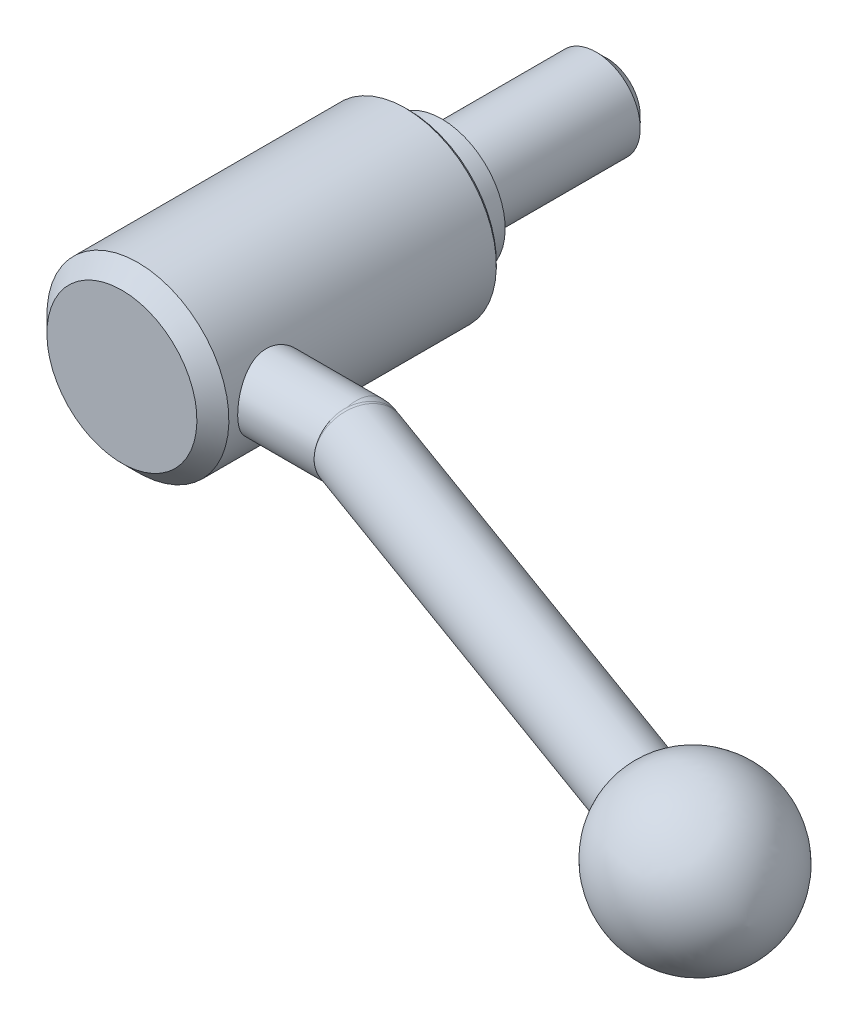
ISO-10303-21;
HEADER;
FILE_DESCRIPTION(('STEP AP214'),'2;1');
FILE_NAME('part.step','',(''),(''),'','','');
FILE_SCHEMA(('AUTOMOTIVE_DESIGN { 1 0 10303 214 1 1 1 1 }'));
ENDSEC;
DATA;
#1=APPLICATION_CONTEXT('core data for automotive mechanical design processes');
#2=APPLICATION_PROTOCOL_DEFINITION('international standard','automotive_design',2000,#1);
#3=PRODUCT_CONTEXT('',#1,'mechanical');
#4=PRODUCT('Part','Part','',(#3));
#5=PRODUCT_RELATED_PRODUCT_CATEGORY('part','',(#4));
#6=PRODUCT_DEFINITION_FORMATION('','',#4);
#7=PRODUCT_DEFINITION_CONTEXT('part definition',#1,'design');
#8=PRODUCT_DEFINITION('design','',#6,#7);
#9=PRODUCT_DEFINITION_SHAPE('','',#8);
#10=(LENGTH_UNIT() NAMED_UNIT(*) SI_UNIT(.MILLI.,.METRE.));
#11=(NAMED_UNIT(*) PLANE_ANGLE_UNIT() SI_UNIT($,.RADIAN.));
#12=(NAMED_UNIT(*) SI_UNIT($,.STERADIAN.) SOLID_ANGLE_UNIT());
#13=UNCERTAINTY_MEASURE_WITH_UNIT(LENGTH_MEASURE(1.E-05),#10,'distance_accuracy_value','');
#14=(GEOMETRIC_REPRESENTATION_CONTEXT(3) GLOBAL_UNCERTAINTY_ASSIGNED_CONTEXT((#13)) GLOBAL_UNIT_ASSIGNED_CONTEXT((#10,
#11,#12)) REPRESENTATION_CONTEXT('',''));
#15=CARTESIAN_POINT('',(0.,0.,0.));
#16=DIRECTION('',(0.,0.,1.));
#17=DIRECTION('',(1.,0.,0.));
#18=AXIS2_PLACEMENT_3D('',#15,#16,#17);
#19=CARTESIAN_POINT('',(0.,0.,0.));
#20=DIRECTION('',(0.,0.,-1.));
#21=DIRECTION('',(0.,1.,0.));
#22=AXIS2_PLACEMENT_3D('',#19,#20,#21);
#23=CYLINDRICAL_SURFACE('',#22,16.5);
#24=CARTESIAN_POINT('',(0.,0.,6.6));
#25=DIRECTION('',(0.,0.,-1.));
#26=DIRECTION('',(0.,1.,0.));
#27=AXIS2_PLACEMENT_3D('',#24,#25,#26);
#28=CIRCLE('',#27,16.5);
#29=CARTESIAN_POINT('',(0.,16.5,6.6));
#30=VERTEX_POINT('',#29);
#31=EDGE_CURVE('E147',#30,#30,#28,.T.);
#32=ORIENTED_EDGE('',*,*,#31,.F.);
#33=EDGE_LOOP('',(#32));
#34=FACE_BOUND('',#33,.T.);
#35=CARTESIAN_POINT('',(15.1657508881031,6.5,47.));
#36=CARTESIAN_POINT('',(15.1657521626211,6.49999870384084,47.1744094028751));
#37=CARTESIAN_POINT('',(15.1687696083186,6.49297069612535,47.3488754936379));
#38=CARTESIAN_POINT('',(15.180743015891,6.4649258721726,47.6965510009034));
#39=CARTESIAN_POINT('',(15.1897026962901,6.44390029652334,47.8697595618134));
#40=CARTESIAN_POINT('',(15.2132851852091,6.38802582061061,48.2139084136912));
#41=CARTESIAN_POINT('',(15.2279195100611,6.35314880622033,48.3848433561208));
#42=CARTESIAN_POINT('',(15.2623783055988,6.26991497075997,48.722930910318));
#43=CARTESIAN_POINT('',(15.2822049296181,6.22155255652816,48.890081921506));
#44=CARTESIAN_POINT('',(15.3263305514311,6.11204204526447,49.2187433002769));
#45=CARTESIAN_POINT('',(15.3506106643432,6.05094779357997,49.3802741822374));
#46=CARTESIAN_POINT('',(15.4029879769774,5.91634808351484,49.6975038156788));
#47=CARTESIAN_POINT('',(15.4310866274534,5.84283790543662,49.8532003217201));
#48=CARTESIAN_POINT('',(15.4902847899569,5.68403460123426,50.1577239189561));
#49=CARTESIAN_POINT('',(15.521382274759,5.59874941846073,50.3065555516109));
#50=CARTESIAN_POINT('',(15.5857773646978,5.41690395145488,50.5967321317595));
#51=CARTESIAN_POINT('',(15.6190757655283,5.32033957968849,50.7380743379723));
#52=CARTESIAN_POINT('',(15.6887204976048,5.11143504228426,51.0193834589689));
#53=CARTESIAN_POINT('',(15.7251359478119,4.99854682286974,51.1589265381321));
#54=CARTESIAN_POINT('',(15.7984684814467,4.76169722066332,51.4281356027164));
#55=CARTESIAN_POINT('',(15.8353855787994,4.6377355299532,51.5578013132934));
#56=CARTESIAN_POINT('',(15.9087724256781,4.37938333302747,51.8065762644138));
#57=CARTESIAN_POINT('',(15.9452419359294,4.24498750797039,51.9256800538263));
#58=CARTESIAN_POINT('',(16.0167582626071,3.96662276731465,52.1524872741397));
#59=CARTESIAN_POINT('',(16.0518055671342,3.82265718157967,52.2601946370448));
#60=CARTESIAN_POINT('',(16.1208941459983,3.52019152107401,52.467462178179));
#61=CARTESIAN_POINT('',(16.1548445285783,3.3613450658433,52.5665481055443));
#62=CARTESIAN_POINT('',(16.2192807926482,3.03521726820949,52.7508716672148));
#63=CARTESIAN_POINT('',(16.2497679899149,2.86793916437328,52.8361145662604));
#64=CARTESIAN_POINT('',(16.306415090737,2.52603369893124,52.9920322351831));
#65=CARTESIAN_POINT('',(16.3325754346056,2.35140708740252,53.062708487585));
#66=CARTESIAN_POINT('',(16.3798001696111,1.99606140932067,53.1888023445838));
#67=CARTESIAN_POINT('',(16.4008648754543,1.81534271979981,53.2442208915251));
#68=CARTESIAN_POINT('',(16.4364052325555,1.45784632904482,53.3369679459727));
#69=CARTESIAN_POINT('',(16.4511444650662,1.28128382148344,53.3750254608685));
#70=CARTESIAN_POINT('',(16.4750042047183,0.925236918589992,53.4363470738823));
#71=CARTESIAN_POINT('',(16.4841250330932,0.745752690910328,53.4596120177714));
#72=CARTESIAN_POINT('',(16.4964855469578,0.38532015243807,53.4910896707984));
#73=CARTESIAN_POINT('',(16.4997269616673,0.204372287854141,53.4993068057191));
#74=CARTESIAN_POINT('',(16.5002398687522,-0.157583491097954,53.500608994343));
#75=CARTESIAN_POINT('',(16.4975115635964,-0.33859140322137,53.4936945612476));
#76=CARTESIAN_POINT('',(16.4864766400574,-0.689328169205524,53.465606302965));
#77=CARTESIAN_POINT('',(16.4784837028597,-0.85913183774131,53.4452341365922));
#78=CARTESIAN_POINT('',(16.4574384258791,-1.19635679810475,53.3912360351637));
#79=CARTESIAN_POINT('',(16.444384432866,-1.36377729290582,53.3576057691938));
#80=CARTESIAN_POINT('',(16.4135516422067,-1.69498665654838,53.2774234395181));
#81=CARTESIAN_POINT('',(16.3957743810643,-1.85877668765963,53.2308755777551));
#82=CARTESIAN_POINT('',(16.3559249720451,-2.18179127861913,53.1252488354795));
#83=CARTESIAN_POINT('',(16.3338511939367,-2.34101407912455,53.0661651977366));
#84=CARTESIAN_POINT('',(16.2855961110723,-2.65615140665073,52.9350157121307));
#85=CARTESIAN_POINT('',(16.2593596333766,-2.81198390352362,52.8627732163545));
#86=CARTESIAN_POINT('',(16.2036445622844,-3.11704287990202,52.7064377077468));
#87=CARTESIAN_POINT('',(16.1741648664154,-3.26626708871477,52.6223406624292));
#88=CARTESIAN_POINT('',(16.1126670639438,-3.55725721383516,52.4428984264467));
#89=CARTESIAN_POINT('',(16.0806487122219,-3.69902240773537,52.3475521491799));
#90=CARTESIAN_POINT('',(16.0148235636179,-3.97435099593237,52.1462241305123));
#91=CARTESIAN_POINT('',(15.9810166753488,-4.10791397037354,52.0402418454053));
#92=CARTESIAN_POINT('',(15.9101988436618,-4.37444690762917,51.8111373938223));
#93=CARTESIAN_POINT('',(15.8731214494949,-4.50682971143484,51.687351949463));
#94=CARTESIAN_POINT('',(15.7988232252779,-4.76074389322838,51.4292307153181));
#95=CARTESIAN_POINT('',(15.7616024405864,-4.88227844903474,51.2948980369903));
#96=CARTESIAN_POINT('',(15.6879834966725,-5.11389804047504,51.0163266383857));
#97=CARTESIAN_POINT('',(15.6515859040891,-5.22397536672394,50.8720813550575));
#98=CARTESIAN_POINT('',(15.5806672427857,-5.43183822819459,50.5746385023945));
#99=CARTESIAN_POINT('',(15.5461454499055,-5.52962852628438,50.4214444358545));
#100=CARTESIAN_POINT('',(15.4790662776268,-5.71475871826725,50.1026478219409));
#101=CARTESIAN_POINT('',(15.4465879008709,-5.80174188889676,49.936821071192));
#102=CARTESIAN_POINT('',(15.3857195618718,-5.96128563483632,49.5977234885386));
#103=CARTESIAN_POINT('',(15.3573279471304,-6.03385204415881,49.4244557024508));
#104=CARTESIAN_POINT('',(15.3055990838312,-6.16388979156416,49.0716641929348));
#105=CARTESIAN_POINT('',(15.2822603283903,-6.22136563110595,48.8921423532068));
#106=CARTESIAN_POINT('',(15.2414756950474,-6.32062540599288,48.5281589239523));
#107=CARTESIAN_POINT('',(15.2240293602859,-6.36241055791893,48.3436977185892));
#108=CARTESIAN_POINT('',(15.1965377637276,-6.42778493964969,47.9824635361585));
#109=CARTESIAN_POINT('',(15.1861129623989,-6.45231123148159,47.8058886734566));
#110=CARTESIAN_POINT('',(15.1714222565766,-6.48677897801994,47.4510697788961));
#111=CARTESIAN_POINT('',(15.1671560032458,-6.4967212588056,47.2728258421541));
#112=CARTESIAN_POINT('',(15.1649343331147,-6.5019054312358,46.9161296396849));
#113=CARTESIAN_POINT('',(15.1669773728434,-6.49715091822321,46.7376774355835));
#114=CARTESIAN_POINT('',(15.1772980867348,-6.47300508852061,46.3819515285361));
#115=CARTESIAN_POINT('',(15.1855756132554,-6.45361411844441,46.2046777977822));
#116=CARTESIAN_POINT('',(15.2074545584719,-6.40187966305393,45.8623519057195));
#117=CARTESIAN_POINT('',(15.2207392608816,-6.37030447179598,45.6971624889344));
#118=CARTESIAN_POINT('',(15.2522135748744,-6.29457395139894,45.3701161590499));
#119=CARTESIAN_POINT('',(15.2704047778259,-6.25041454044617,45.2082603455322));
#120=CARTESIAN_POINT('',(15.3111508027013,-6.1499265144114,44.8889788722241));
#121=CARTESIAN_POINT('',(15.3337047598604,-6.09360031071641,44.7315523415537));
#122=CARTESIAN_POINT('',(15.3825547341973,-5.9692104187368,44.4219440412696));
#123=CARTESIAN_POINT('',(15.4088521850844,-5.90114223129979,44.2697643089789));
#124=CARTESIAN_POINT('',(15.4655807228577,-5.75087055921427,43.9656332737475));
#125=CARTESIAN_POINT('',(15.496133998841,-5.66821518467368,43.8139280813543));
#126=CARTESIAN_POINT('',(15.5596953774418,-5.4913305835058,43.5178983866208));
#127=CARTESIAN_POINT('',(15.5927043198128,-5.39709739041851,43.373576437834));
#128=CARTESIAN_POINT('',(15.6603145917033,-5.19765644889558,43.093084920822));
#129=CARTESIAN_POINT('',(15.6949161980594,-5.09244678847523,42.9569167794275));
#130=CARTESIAN_POINT('',(15.7648419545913,-4.87166967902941,42.6934495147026));
#131=CARTESIAN_POINT('',(15.8001661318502,-4.75610184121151,42.5661507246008));
#132=CARTESIAN_POINT('',(15.8732028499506,-4.50660710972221,42.3123157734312));
#133=CARTESIAN_POINT('',(15.910905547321,-4.37195833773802,42.1864851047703));
#134=CARTESIAN_POINT('',(15.985112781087,-4.09232041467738,41.9466012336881));
#135=CARTESIAN_POINT('',(16.0216176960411,-3.94733457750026,41.8325442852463));
#136=CARTESIAN_POINT('',(16.0924669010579,-3.64776716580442,41.6168903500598));
#137=CARTESIAN_POINT('',(16.1268102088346,-3.4931812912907,41.5152990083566));
#138=CARTESIAN_POINT('',(16.192362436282,-3.17548270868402,41.3254483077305));
#139=CARTESIAN_POINT('',(16.2235726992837,-3.01237370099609,41.2371832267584));
#140=CARTESIAN_POINT('',(16.2819868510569,-2.67872446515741,41.0747287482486));
#141=CARTESIAN_POINT('',(16.3091932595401,-2.50818899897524,41.0005304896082));
#142=CARTESIAN_POINT('',(16.3588360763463,-2.16084294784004,40.8668630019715));
#143=CARTESIAN_POINT('',(16.3812744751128,-1.98403501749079,40.8073876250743));
#144=CARTESIAN_POINT('',(16.4207336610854,-1.62543340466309,40.7037478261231));
#145=CARTESIAN_POINT('',(16.4377556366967,-1.44364082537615,40.6595800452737));
#146=CARTESIAN_POINT('',(16.4658759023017,-1.0764844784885,40.5870294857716));
#147=CARTESIAN_POINT('',(16.4769745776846,-0.89112094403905,40.5586456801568));
#148=CARTESIAN_POINT('',(16.4924035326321,-0.530232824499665,40.5192842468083));
#149=CARTESIAN_POINT('',(16.4971193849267,-0.354832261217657,40.5073144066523));
#150=CARTESIAN_POINT('',(16.5009342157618,-0.003578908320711,40.4976272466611));
#151=CARTESIAN_POINT('',(16.5000333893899,0.172273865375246,40.4999094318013));
#152=CARTESIAN_POINT('',(16.492639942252,0.523072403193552,40.5187002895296));
#153=CARTESIAN_POINT('',(16.4861480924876,0.698018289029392,40.5352070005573));
#154=CARTESIAN_POINT('',(16.4677497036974,1.04571908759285,40.5822707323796));
#155=CARTESIAN_POINT('',(16.4558431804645,1.21847400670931,40.6128277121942));
#156=CARTESIAN_POINT('',(16.427359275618,1.55551611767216,40.6865815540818));
#157=CARTESIAN_POINT('',(16.4109292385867,1.71990302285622,40.7293811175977));
#158=CARTESIAN_POINT('',(16.3736686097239,2.04442213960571,40.8275543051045));
#159=CARTESIAN_POINT('',(16.3528365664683,2.20455292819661,40.8829320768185));
#160=CARTESIAN_POINT('',(16.3072831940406,2.51948953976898,41.0057747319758));
#161=CARTESIAN_POINT('',(16.2825627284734,2.67429653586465,41.0732369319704));
#162=CARTESIAN_POINT('',(16.2298017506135,2.977796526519,41.2197632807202));
#163=CARTESIAN_POINT('',(16.201759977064,3.12648716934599,41.2988318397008));
#164=CARTESIAN_POINT('',(16.1417339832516,3.42320288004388,41.4716706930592));
#165=CARTESIAN_POINT('',(16.1096315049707,3.5709192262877,41.565929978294));
#166=CARTESIAN_POINT('',(16.0433028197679,3.85799821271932,41.7658374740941));
#167=CARTESIAN_POINT('',(16.0090758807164,3.99735794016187,41.8714896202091));
#168=CARTESIAN_POINT('',(15.9393375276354,4.266955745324,42.0935156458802));
#169=CARTESIAN_POINT('',(15.9038258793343,4.39719214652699,42.2098914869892));
#170=CARTESIAN_POINT('',(15.8323930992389,4.647828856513,42.4526787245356));
#171=CARTESIAN_POINT('',(15.796471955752,4.76822888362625,42.5790904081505));
#172=CARTESIAN_POINT('',(15.7229728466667,5.00544246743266,42.8491269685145));
#173=CARTESIAN_POINT('',(15.6854245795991,5.12160881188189,42.9933293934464));
#174=CARTESIAN_POINT('',(15.6119611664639,5.34135661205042,43.2913381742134));
#175=CARTESIAN_POINT('',(15.5760454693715,5.44494233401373,43.4451412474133));
#176=CARTESIAN_POINT('',(15.5068861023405,5.63889116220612,43.76158008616));
#177=CARTESIAN_POINT('',(15.4736440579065,5.72924625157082,43.9242211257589));
#178=CARTESIAN_POINT('',(15.4109193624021,5.89588782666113,44.2571658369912));
#179=CARTESIAN_POINT('',(15.3814348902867,5.9721811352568,44.427465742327));
#180=CARTESIAN_POINT('',(15.3295715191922,6.10399903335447,44.7594125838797));
#181=CARTESIAN_POINT('',(15.3067961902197,6.16075841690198,44.9205080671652));
#182=CARTESIAN_POINT('',(15.2658533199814,6.26152405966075,45.2471430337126));
#183=CARTESIAN_POINT('',(15.2476836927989,6.30553609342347,45.4126804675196));
#184=CARTESIAN_POINT('',(15.2165340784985,6.38033934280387,45.7467976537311));
#185=CARTESIAN_POINT('',(15.2035424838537,6.41116014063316,45.9153697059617));
#186=CARTESIAN_POINT('',(15.183110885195,6.45939917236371,46.2546841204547));
#187=CARTESIAN_POINT('',(15.1756675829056,6.4768253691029,46.4254251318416));
#188=CARTESIAN_POINT('',(15.1693292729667,6.49164558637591,46.6637445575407));
#189=CARTESIAN_POINT('',(15.1679883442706,6.49477751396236,46.7309454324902));
#190=CARTESIAN_POINT('',(15.1661988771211,6.49895503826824,46.8654280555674));
#191=CARTESIAN_POINT('',(15.1657503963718,6.50000050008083,46.9327098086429));
#192=CARTESIAN_POINT('',(15.1657508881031,6.5,47.));
#193=B_SPLINE_CURVE_WITH_KNOTS('',3,(#35,#36,#37,#38,#39,#40,#41,#42,#43,#44,#45,#46,#47,#48,
#49,#50,#51,#52,#53,#54,#55,#56,#57,#58,#59,#60,#61,#62,#63,#64,#65,#66,#67,#68,#69,#70,#71,#72,
#73,#74,#75,#76,#77,#78,#79,#80,#81,#82,#83,#84,#85,#86,#87,#88,#89,#90,#91,#92,#93,#94,#95,#96,
#97,#98,#99,#100,#101,#102,#103,#104,#105,#106,#107,#108,#109,#110,#111,#112,#113,#114,#115,
#116,#117,#118,#119,#120,#121,#122,#123,#124,#125,#126,#127,#128,#129,#130,#131,#132,#133,#134,
#135,#136,#137,#138,#139,#140,#141,#142,#143,#144,#145,#146,#147,#148,#149,#150,#151,#152,#153,
#154,#155,#156,#157,#158,#159,#160,#161,#162,#163,#164,#165,#166,#167,#168,#169,#170,#171,#172,
#173,#174,#175,#176,#177,#178,#179,#180,#181,#182,#183,#184,#185,#186,#187,#188,#189,#190,#191,
#192),.UNSPECIFIED.,.T.,.F.,(4,2,2,2,2,2,2,2,2,2,2,2,2,2,2,2,2,2,2,2,2,2,2,2,2,2,2,2,2,2,2,2,2,
2,2,2,2,2,2,2,2,2,2,2,2,2,2,2,2,2,2,2,2,2,2,2,2,2,2,2,2,2,2,2,2,2,2,2,2,2,2,2,2,2,2,2,2,2,4),
(0.,0.523159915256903,1.04664752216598,1.5712031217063,2.09597660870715,2.61857420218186,
3.14137090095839,3.66381663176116,4.18645228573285,4.73527747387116,5.28411792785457,
5.83324001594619,6.38217202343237,6.95226912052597,7.52214888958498,8.09197063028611,
8.66175716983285,9.20471085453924,9.74763349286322,10.2903964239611,10.8331409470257,
11.3461618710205,11.8593505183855,12.3723724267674,12.8855893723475,13.4062856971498,
13.9271595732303,14.4480838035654,14.9690346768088,15.5233891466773,16.0775806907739,
16.6321427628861,17.186489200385,17.755918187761,18.3251162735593,18.894144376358,
19.4631283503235,19.9981572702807,20.533155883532,21.0680236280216,21.6028787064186,
22.1084143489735,22.6141141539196,23.11971382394,23.6255076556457,24.1512658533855,
24.6772046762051,25.2032352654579,25.7292856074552,26.2929535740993,26.8564416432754,
27.4201839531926,27.9836835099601,28.5468269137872,29.1097347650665,29.6725190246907,
30.235266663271,30.7622239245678,31.2891628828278,31.8160291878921,32.3428939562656,
32.8542954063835,33.3658657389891,33.8773226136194,34.3889743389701,34.9228229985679,
35.4568566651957,35.990988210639,36.5251350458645,37.0912887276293,37.6572498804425,
38.2235525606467,38.7895797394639,39.3059532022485,39.8220923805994,40.3370679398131,
40.851737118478,41.0535682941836,41.2554125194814),.UNSPECIFIED.);
#194=CARTESIAN_POINT('',(15.1657508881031,6.5,47.));
#195=VERTEX_POINT('',#194);
#196=EDGE_CURVE('E77',#195,#195,#193,.T.);
#197=ORIENTED_EDGE('',*,*,#196,.F.);
#198=EDGE_LOOP('',(#197));
#199=FACE_BOUND('',#198,.T.);
#200=CARTESIAN_POINT('',(0.,0.,55.1));
#201=DIRECTION('',(0.,0.,-1.));
#202=DIRECTION('',(0.,1.,0.));
#203=AXIS2_PLACEMENT_3D('',#200,#201,#202);
#204=CIRCLE('',#203,16.5);
#205=CARTESIAN_POINT('',(0.,16.5,55.1));
#206=VERTEX_POINT('',#205);
#207=EDGE_CURVE('E149',#206,#206,#204,.T.);
#208=ORIENTED_EDGE('',*,*,#207,.T.);
#209=EDGE_LOOP('',(#208));
#210=FACE_BOUND('',#209,.T.);
#211=ADVANCED_FACE('F14',(#34,#199,#210),#23,.T.);
#212=CARTESIAN_POINT('',(0.,0.,58.));
#213=DIRECTION('',(0.,0.,-1.));
#214=DIRECTION('',(0.,1.,0.));
#215=AXIS2_PLACEMENT_3D('',#212,#213,#214);
#216=PLANE('',#215);
#217=CARTESIAN_POINT('',(0.,0.,58.));
#218=DIRECTION('',(0.,0.,-1.));
#219=DIRECTION('',(0.,1.,0.));
#220=AXIS2_PLACEMENT_3D('',#217,#218,#219);
#221=CIRCLE('',#220,13.6);
#222=CARTESIAN_POINT('',(0.,13.6,58.));
#223=VERTEX_POINT('',#222);
#224=EDGE_CURVE('E85',#223,#223,#221,.T.);
#225=ORIENTED_EDGE('',*,*,#224,.F.);
#226=EDGE_LOOP('',(#225));
#227=FACE_BOUND('',#226,.T.);
#228=ADVANCED_FACE('F61',(#227),#216,.F.);
#229=CARTESIAN_POINT('',(0.,0.,58.));
#230=DIRECTION('',(0.,0.,-1.));
#231=DIRECTION('',(0.,1.,0.));
#232=AXIS2_PLACEMENT_3D('',#229,#230,#231);
#233=CONICAL_SURFACE('',#232,13.6,0.785398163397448);
#234=ORIENTED_EDGE('',*,*,#207,.F.);
#235=EDGE_LOOP('',(#234));
#236=FACE_BOUND('',#235,.T.);
#237=ORIENTED_EDGE('',*,*,#224,.T.);
#238=EDGE_LOOP('',(#237));
#239=FACE_BOUND('',#238,.T.);
#240=ADVANCED_FACE('F67',(#236,#239),#233,.T.);
#241=CARTESIAN_POINT('',(0.,0.,6.6));
#242=DIRECTION('',(0.,0.,1.));
#243=DIRECTION('',(0.,-1.,0.));
#244=AXIS2_PLACEMENT_3D('',#241,#242,#243);
#245=CONICAL_SURFACE('',#244,16.5,0.785398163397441);
#246=CARTESIAN_POINT('',(0.,0.,6.));
#247=DIRECTION('',(0.,0.,-1.));
#248=DIRECTION('',(0.,1.,0.));
#249=AXIS2_PLACEMENT_3D('',#246,#247,#248);
#250=CIRCLE('',#249,15.9);
#251=CARTESIAN_POINT('',(0.,15.9,6.));
#252=VERTEX_POINT('',#251);
#253=EDGE_CURVE('E142',#252,#252,#250,.T.);
#254=ORIENTED_EDGE('',*,*,#253,.F.);
#255=EDGE_LOOP('',(#254));
#256=FACE_BOUND('',#255,.T.);
#257=ORIENTED_EDGE('',*,*,#31,.T.);
#258=EDGE_LOOP('',(#257));
#259=FACE_BOUND('',#258,.T.);
#260=ADVANCED_FACE('F74',(#256,#259),#245,.T.);
#261=CARTESIAN_POINT('',(15.9,0.,6.));
#262=DIRECTION('',(0.,0.,1.));
#263=DIRECTION('',(0.,-1.,0.));
#264=AXIS2_PLACEMENT_3D('',#261,#262,#263);
#265=PLANE('',#264);
#266=CARTESIAN_POINT('',(0.,0.,6.));
#267=DIRECTION('',(0.,0.,-1.));
#268=DIRECTION('',(0.,1.,0.));
#269=AXIS2_PLACEMENT_3D('',#266,#267,#268);
#270=CIRCLE('',#269,11.5);
#271=CARTESIAN_POINT('',(0.,11.5,6.));
#272=VERTEX_POINT('',#271);
#273=EDGE_CURVE('E140',#272,#272,#270,.T.);
#274=ORIENTED_EDGE('',*,*,#273,.F.);
#275=EDGE_LOOP('',(#274));
#276=FACE_BOUND('',#275,.T.);
#277=ORIENTED_EDGE('',*,*,#253,.T.);
#278=EDGE_LOOP('',(#277));
#279=FACE_BOUND('',#278,.T.);
#280=ADVANCED_FACE('F161',(#276,#279),#265,.F.);
#281=CARTESIAN_POINT('',(0.,0.,0.));
#282=DIRECTION('',(0.,0.,-1.));
#283=DIRECTION('',(0.,1.,0.));
#284=AXIS2_PLACEMENT_3D('',#281,#282,#283);
#285=CYLINDRICAL_SURFACE('',#284,11.5);
#286=CARTESIAN_POINT('',(0.,0.,0.));
#287=DIRECTION('',(0.,0.,-1.));
#288=DIRECTION('',(0.,1.,0.));
#289=AXIS2_PLACEMENT_3D('',#286,#287,#288);
#290=CIRCLE('',#289,11.5);
#291=CARTESIAN_POINT('',(0.,11.5,0.));
#292=VERTEX_POINT('',#291);
#293=EDGE_CURVE('E138',#292,#292,#290,.T.);
#294=ORIENTED_EDGE('',*,*,#293,.F.);
#295=EDGE_LOOP('',(#294));
#296=FACE_BOUND('',#295,.T.);
#297=ORIENTED_EDGE('',*,*,#273,.T.);
#298=EDGE_LOOP('',(#297));
#299=FACE_BOUND('',#298,.T.);
#300=ADVANCED_FACE('F135',(#296,#299),#285,.T.);
#301=CARTESIAN_POINT('',(11.5,0.,0.));
#302=DIRECTION('',(0.,0.,1.));
#303=DIRECTION('',(0.,-1.,0.));
#304=AXIS2_PLACEMENT_3D('',#301,#302,#303);
#305=PLANE('',#304);
#306=CARTESIAN_POINT('',(0.,0.,0.));
#307=DIRECTION('',(0.,0.,-1.));
#308=DIRECTION('',(0.,1.,0.));
#309=AXIS2_PLACEMENT_3D('',#306,#307,#308);
#310=CIRCLE('',#309,8.);
#311=CARTESIAN_POINT('',(0.,8.,0.));
#312=VERTEX_POINT('',#311);
#313=EDGE_CURVE('E126',#312,#312,#310,.T.);
#314=ORIENTED_EDGE('',*,*,#313,.F.);
#315=EDGE_LOOP('',(#314));
#316=FACE_BOUND('',#315,.T.);
#317=ORIENTED_EDGE('',*,*,#293,.T.);
#318=EDGE_LOOP('',(#317));
#319=FACE_BOUND('',#318,.T.);
#320=ADVANCED_FACE('F93',(#316,#319),#305,.F.);
#321=CARTESIAN_POINT('',(38.,0.,47.));
#322=DIRECTION('',(1.,0.,0.));
#323=DIRECTION('',(0.,1.,0.));
#324=AXIS2_PLACEMENT_3D('',#321,#322,#323);
#325=CYLINDRICAL_SURFACE('',#324,6.5);
#326=CARTESIAN_POINT('',(31.5002,-6.28048269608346,48.6749737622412));
#327=CARTESIAN_POINT('',(31.4701911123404,-6.25848550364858,48.7574684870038));
#328=CARTESIAN_POINT('',(31.4414052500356,-6.2347500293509,48.8399237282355));
#329=CARTESIAN_POINT('',(31.3859523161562,-6.18381246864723,49.0044625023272));
#330=CARTESIAN_POINT('',(31.3592849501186,-6.15661086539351,49.0865460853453));
#331=CARTESIAN_POINT('',(31.2819864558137,-6.06984393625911,49.3317442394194));
#332=CARTESIAN_POINT('',(31.234026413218,-6.00509209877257,49.4938982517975));
#333=CARTESIAN_POINT('',(31.1437652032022,-5.86212891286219,49.8135555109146));
#334=CARTESIAN_POINT('',(31.1014588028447,-5.78393016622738,49.971062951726));
#335=CARTESIAN_POINT('',(31.0215196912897,-5.61443273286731,50.2801227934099));
#336=CARTESIAN_POINT('',(30.9838873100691,-5.52313312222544,50.4316747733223));
#337=CARTESIAN_POINT('',(30.9127228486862,-5.32805112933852,50.7273614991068));
#338=CARTESIAN_POINT('',(30.8791877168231,-5.22427815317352,50.871501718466));
#339=CARTESIAN_POINT('',(30.815774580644,-5.00483968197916,51.1512875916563));
#340=CARTESIAN_POINT('',(30.7858966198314,-4.88917404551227,51.2869331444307));
#341=CARTESIAN_POINT('',(30.7295154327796,-4.64671898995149,51.548605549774));
#342=CARTESIAN_POINT('',(30.7030116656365,-4.51993135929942,51.6746339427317));
#343=CARTESIAN_POINT('',(30.6531671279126,-4.25605741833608,51.9160918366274));
#344=CARTESIAN_POINT('',(30.6298263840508,-4.1189710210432,52.0315212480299));
#345=CARTESIAN_POINT('',(30.5859306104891,-3.83395076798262,52.2520111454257));
#346=CARTESIAN_POINT('',(30.5654071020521,-3.68591886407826,52.3569512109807));
#347=CARTESIAN_POINT('',(30.527316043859,-3.38127311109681,52.5542722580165));
#348=CARTESIAN_POINT('',(30.5097495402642,-3.22465625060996,52.6466487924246));
#349=CARTESIAN_POINT('',(30.4775004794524,-2.90402878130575,52.8180456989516));
#350=CARTESIAN_POINT('',(30.4628174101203,-2.74001949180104,52.8970684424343));
#351=CARTESIAN_POINT('',(30.4362651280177,-2.40569424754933,53.0411738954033));
#352=CARTESIAN_POINT('',(30.424396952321,-2.23537599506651,53.1062514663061));
#353=CARTESIAN_POINT('',(30.4035252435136,-1.89117431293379,53.2214241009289));
#354=CARTESIAN_POINT('',(30.3944984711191,-1.71733288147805,53.2716404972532));
#355=CARTESIAN_POINT('',(30.3791416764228,-1.3658896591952,53.3574425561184));
#356=CARTESIAN_POINT('',(30.3728126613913,-1.18828648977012,53.3930227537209));
#357=CARTESIAN_POINT('',(30.3628391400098,-0.830755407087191,53.4492305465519));
#358=CARTESIAN_POINT('',(30.3591931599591,-0.650828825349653,53.4698663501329));
#359=CARTESIAN_POINT('',(30.3545680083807,-0.289765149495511,53.496061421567));
#360=CARTESIAN_POINT('',(30.3535900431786,-0.108627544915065,53.5016138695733));
#361=CARTESIAN_POINT('',(30.3542996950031,0.252555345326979,53.4975893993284));
#362=CARTESIAN_POINT('',(30.355973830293,0.432601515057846,53.4880890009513));
#363=CARTESIAN_POINT('',(30.3619660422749,0.79115770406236,53.4541833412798));
#364=CARTESIAN_POINT('',(30.3662829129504,0.969668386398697,53.429784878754));
#365=CARTESIAN_POINT('',(30.3775753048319,1.32405576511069,53.3662625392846));
#366=CARTESIAN_POINT('',(30.384552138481,1.49993111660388,53.3271313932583));
#367=CARTESIAN_POINT('',(30.4011832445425,1.84764570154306,53.2344660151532));
#368=CARTESIAN_POINT('',(30.4108365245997,2.01948640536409,53.1809371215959));
#369=CARTESIAN_POINT('',(30.4328583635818,2.35804742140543,53.0598634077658));
#370=CARTESIAN_POINT('',(30.4452278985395,2.52476586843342,52.9923135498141));
#371=CARTESIAN_POINT('',(30.4727213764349,2.85178734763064,52.843761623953));
#372=CARTESIAN_POINT('',(30.4878443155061,3.01209269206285,52.7627644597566));
#373=CARTESIAN_POINT('',(30.5209144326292,3.32526997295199,52.5879110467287));
#374=CARTESIAN_POINT('',(30.5388622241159,3.47814028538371,52.4940520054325));
#375=CARTESIAN_POINT('',(30.5776589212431,3.77530504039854,52.2942532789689));
#376=CARTESIAN_POINT('',(30.5985068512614,3.91960234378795,52.1883176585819));
#377=CARTESIAN_POINT('',(30.6433408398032,4.19941993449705,51.9645872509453));
#378=CARTESIAN_POINT('',(30.6673426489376,4.33489069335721,51.8467336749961));
#379=CARTESIAN_POINT('',(30.7185603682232,4.59531298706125,51.6005655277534));
#380=CARTESIAN_POINT('',(30.7457763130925,4.72026440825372,51.4722508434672));
#381=CARTESIAN_POINT('',(30.8036465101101,4.95882988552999,51.20617837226));
#382=CARTESIAN_POINT('',(30.8343011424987,5.07244268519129,51.0684195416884));
#383=CARTESIAN_POINT('',(30.8993555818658,5.28757920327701,50.7846019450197));
#384=CARTESIAN_POINT('',(30.9337552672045,5.38910331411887,50.6385434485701));
#385=CARTESIAN_POINT('',(31.0048466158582,5.5744837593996,50.3471450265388));
#386=CARTESIAN_POINT('',(31.0413260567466,5.65898432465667,50.2021627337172));
#387=CARTESIAN_POINT('',(31.1186048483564,5.81610839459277,49.9070309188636));
#388=CARTESIAN_POINT('',(31.1594036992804,5.88873327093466,49.7568819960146));
#389=CARTESIAN_POINT('',(31.2461889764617,6.0218129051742,49.4526179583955));
#390=CARTESIAN_POINT('',(31.2921778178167,6.08226196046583,49.2985010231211));
#391=CARTESIAN_POINT('',(31.366062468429,6.16360062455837,49.0656236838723));
#392=CARTESIAN_POINT('',(31.3915152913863,6.18916346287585,48.9876924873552));
#393=CARTESIAN_POINT('',(31.4443438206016,6.23716716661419,48.8315099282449));
#394=CARTESIAN_POINT('',(31.4717197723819,6.25960763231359,48.753258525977));
#395=CARTESIAN_POINT('',(31.5001999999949,6.28048269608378,48.6749737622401));
#396=B_SPLINE_CURVE_WITH_KNOTS('',3,(#326,#327,#328,#329,#330,#331,#332,#333,#334,#335,#336,
#337,#338,#339,#340,#341,#342,#343,#344,#345,#346,#347,#348,#349,#350,#351,#352,#353,#354,#355,
#356,#357,#358,#359,#360,#361,#362,#363,#364,#365,#366,#367,#368,#369,#370,#371,#372,#373,#374,
#375,#376,#377,#378,#379,#380,#381,#382,#383,#384,#385,#386,#387,#388,#389,#390,#391,#392,#393,
#394,#395),.UNSPECIFIED.,.F.,.F.,(4,2,2,2,2,2,2,2,2,2,2,2,2,2,2,2,2,2,2,2,2,2,2,2,2,2,2,2,2,2,2,
2,2,2,4),(0.,0.27143395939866,0.542830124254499,1.08532167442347,1.62730757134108,
2.16933170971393,2.71094964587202,3.25257402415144,3.79411146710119,4.3356534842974,
4.88283172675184,5.43020315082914,5.97747727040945,6.52495270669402,7.06782653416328,
7.61090287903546,8.15368070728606,8.69670390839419,9.23697554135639,9.77700080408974,
10.3172928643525,10.8573848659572,11.3976712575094,11.9377610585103,12.4779683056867,
13.0179942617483,13.5608276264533,14.1036668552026,14.6465661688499,15.1894478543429,
15.7040975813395,16.2186878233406,16.733518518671,16.9910761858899,17.2486667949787),.UNSPECIFIED.);
#397=CARTESIAN_POINT('',(31.5,-6.28033613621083,48.6755232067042));
#398=VERTEX_POINT('',#397);
#399=CARTESIAN_POINT('',(30.3538746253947,0.,53.5));
#400=VERTEX_POINT('',#399);
#401=EDGE_CURVE('E29',#398,#400,#396,.T.);
#402=ORIENTED_EDGE('',*,*,#401,.T.);
#403=CARTESIAN_POINT('',(31.5,6.28033613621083,48.6755232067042));
#404=VERTEX_POINT('',#403);
#405=EDGE_CURVE('E98',#400,#404,#396,.T.);
#406=ORIENTED_EDGE('',*,*,#405,.T.);
#407=CARTESIAN_POINT('',(31.5,0.,47.));
#408=DIRECTION('',(1.,0.,0.));
#409=DIRECTION('',(0.,1.,0.));
#410=AXIS2_PLACEMENT_3D('',#407,#408,#409);
#411=CIRCLE('',#410,6.5);
#412=EDGE_CURVE('E107',#398,#404,#411,.T.);
#413=ORIENTED_EDGE('',*,*,#412,.F.);
#414=EDGE_LOOP('',(#402,#406,#413));
#415=FACE_BOUND('',#414,.T.);
#416=ORIENTED_EDGE('',*,*,#196,.T.);
#417=EDGE_LOOP('',(#416));
#418=FACE_BOUND('',#417,.T.);
#419=ADVANCED_FACE('F87',(#415,#418),#325,.T.);
#420=CARTESIAN_POINT('',(31.5,0.,47.));
#421=DIRECTION('',(1.,0.,0.));
#422=DIRECTION('',(0.,0.,-1.));
#423=AXIS2_PLACEMENT_3D('',#420,#421,#422);
#424=SPHERICAL_SURFACE('',#423,6.5);
#425=CARTESIAN_POINT('',(32.0385027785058,0.,47.1959989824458));
#426=DIRECTION('',(0.939692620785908,0.,0.342020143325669));
#427=DIRECTION('',(-0.342020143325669,0.,0.939692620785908));
#428=AXIS2_PLACEMENT_3D('',#425,#426,#427);
#429=CIRCLE('',#428,6.47468911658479);
#430=EDGE_CURVE('E36',#398,#404,#429,.T.);
#431=ORIENTED_EDGE('',*,*,#430,.F.);
#432=ORIENTED_EDGE('',*,*,#412,.T.);
#433=EDGE_LOOP('',(#431,#432));
#434=FACE_BOUND('',#433,.T.);
#435=ADVANCED_FACE('F92',(#434),#424,.T.);
#436=CARTESIAN_POINT('',(32.5770055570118,0.,47.3919979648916));
#437=DIRECTION('',(0.939692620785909,0.,0.342020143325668));
#438=DIRECTION('',(-0.342020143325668,0.,0.939692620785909));
#439=AXIS2_PLACEMENT_3D('',#436,#437,#438);
#440=SPHERICAL_SURFACE('',#439,6.5);
#441=ORIENTED_EDGE('',*,*,#401,.F.);
#442=ORIENTED_EDGE('',*,*,#430,.T.);
#443=ORIENTED_EDGE('',*,*,#405,.F.);
#444=CARTESIAN_POINT('',(32.5770055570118,0.,47.3919979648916));
#445=DIRECTION('',(0.939692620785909,0.,0.342020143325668));
#446=DIRECTION('',(-0.342020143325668,0.,0.939692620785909));
#447=AXIS2_PLACEMENT_3D('',#444,#445,#446);
#448=CIRCLE('',#447,6.5);
#449=EDGE_CURVE('E105',#400,#400,#448,.T.);
#450=ORIENTED_EDGE('',*,*,#449,.F.);
#451=EDGE_LOOP('',(#441,#442,#443,#450));
#452=FACE_BOUND('',#451,.T.);
#453=ADVANCED_FACE('F109',(#452),#440,.T.);
#454=CARTESIAN_POINT('',(143.071394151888,0.,87.6086664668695));
#455=DIRECTION('',(0.939692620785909,0.,0.342020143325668));
#456=DIRECTION('',(-0.342020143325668,0.,0.939692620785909));
#457=AXIS2_PLACEMENT_3D('',#454,#455,#456);
#458=CYLINDRICAL_SURFACE('',#457,6.5);
#459=CARTESIAN_POINT('',(116.052479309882,0.,77.774585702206));
#460=DIRECTION('',(0.939692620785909,0.,0.342020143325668));
#461=DIRECTION('',(-0.342020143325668,0.,0.939692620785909));
#462=AXIS2_PLACEMENT_3D('',#459,#460,#461);
#463=CIRCLE('',#462,6.5);
#464=CARTESIAN_POINT('',(113.829348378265,0.,83.8825877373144));
#465=VERTEX_POINT('',#464);
#466=EDGE_CURVE('E121',#465,#465,#463,.T.);
#467=ORIENTED_EDGE('',*,*,#466,.F.);
#468=EDGE_LOOP('',(#467));
#469=FACE_BOUND('',#468,.T.);
#470=ORIENTED_EDGE('',*,*,#449,.T.);
#471=EDGE_LOOP('',(#470));
#472=FACE_BOUND('',#471,.T.);
#473=ADVANCED_FACE('F56',(#469,#472),#458,.T.);
#474=CARTESIAN_POINT('',(113.829348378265,0.,83.8825877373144));
#475=DIRECTION('',(0.939692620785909,0.,0.342020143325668));
#476=DIRECTION('',(-0.342020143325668,0.,0.939692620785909));
#477=AXIS2_PLACEMENT_3D('',#474,#475,#476);
#478=PLANE('',#477);
#479=CARTESIAN_POINT('',(116.052479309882,0.,77.774585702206));
#480=DIRECTION('',(0.939692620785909,0.,0.342020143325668));
#481=DIRECTION('',(-0.342020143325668,0.,0.939692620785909));
#482=AXIS2_PLACEMENT_3D('',#479,#480,#481);
#483=CIRCLE('',#482,8.37359520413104);
#484=CARTESIAN_POINT('',(113.188541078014,0.,85.6431913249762));
#485=VERTEX_POINT('',#484);
#486=EDGE_CURVE('E124',#485,#485,#483,.T.);
#487=ORIENTED_EDGE('',*,*,#486,.F.);
#488=EDGE_LOOP('',(#487));
#489=FACE_BOUND('',#488,.T.);
#490=ORIENTED_EDGE('',*,*,#466,.T.);
#491=EDGE_LOOP('',(#490));
#492=FACE_BOUND('',#491,.T.);
#493=ADVANCED_FACE('F45',(#489,#492),#478,.F.);
#494=CARTESIAN_POINT('',(128.5,0.,81.));
#495=DIRECTION('',(0.,1.,0.));
#496=DIRECTION('',(-0.342020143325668,0.,0.939692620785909));
#497=AXIS2_PLACEMENT_3D('',#494,#495,#496);
#498=CIRCLE('',#497,16.);
#499=TRIMMED_CURVE('',#498,(PARAMETER_VALUE(-1.49407077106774)),
(PARAMETER_VALUE(1.49407077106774)),.T.,.PARAMETER.);
#500=CARTESIAN_POINT('',(128.080544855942,0.,82.1524435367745));
#501=DIRECTION('',(0.939692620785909,0.,0.342020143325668));
#502=AXIS1_PLACEMENT('',#500,#501);
#503=SURFACE_OF_REVOLUTION('',#499,#502);
#504=ORIENTED_EDGE('',*,*,#486,.T.);
#505=EDGE_LOOP('',(#504));
#506=FACE_BOUND('',#505,.T.);
#507=CARTESIAN_POINT('',(143.071394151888,0.,87.6086664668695));
#508=VERTEX_POINT('',#507);
#509=VERTEX_LOOP('',#508);
#510=FACE_BOUND('',#509,.T.);
#511=ADVANCED_FACE('F42',(#506,#510),#503,.T.);
#512=CARTESIAN_POINT('',(0.,0.,23.));
#513=DIRECTION('',(0.,0.,-1.));
#514=DIRECTION('',(-1.,0.,0.));
#515=AXIS2_PLACEMENT_3D('',#512,#513,#514);
#516=CYLINDRICAL_SURFACE('',#515,8.);
#517=CARTESIAN_POINT('',(0.,0.,-28.));
#518=DIRECTION('',(0.,0.,-1.));
#519=DIRECTION('',(-1.,0.,0.));
#520=AXIS2_PLACEMENT_3D('',#517,#518,#519);
#521=CIRCLE('',#520,8.);
#522=CARTESIAN_POINT('',(-8.,0.,-28.));
#523=VERTEX_POINT('',#522);
#524=EDGE_CURVE('E9',#523,#523,#521,.F.);
#525=ORIENTED_EDGE('',*,*,#524,.T.);
#526=EDGE_LOOP('',(#525));
#527=FACE_BOUND('',#526,.T.);
#528=ORIENTED_EDGE('',*,*,#313,.T.);
#529=EDGE_LOOP('',(#528));
#530=FACE_BOUND('',#529,.T.);
#531=ADVANCED_FACE('F44',(#527,#530),#516,.T.);
#532=CARTESIAN_POINT('',(0.,0.,-30.));
#533=DIRECTION('',(0.,0.,-1.));
#534=DIRECTION('',(-1.,0.,0.));
#535=AXIS2_PLACEMENT_3D('',#532,#533,#534);
#536=PLANE('',#535);
#537=CARTESIAN_POINT('',(0.,0.,-30.));
#538=DIRECTION('',(0.,0.,-1.));
#539=DIRECTION('',(-1.,0.,0.));
#540=AXIS2_PLACEMENT_3D('',#537,#538,#539);
#541=CIRCLE('',#540,6.);
#542=CARTESIAN_POINT('',(-6.,0.,-30.));
#543=VERTEX_POINT('',#542);
#544=EDGE_CURVE('E22',#543,#543,#541,.T.);
#545=ORIENTED_EDGE('',*,*,#544,.T.);
#546=EDGE_LOOP('',(#545));
#547=FACE_BOUND('',#546,.T.);
#548=ADVANCED_FACE('F53',(#547),#536,.T.);
#549=CARTESIAN_POINT('',(0.,0.,-30.));
#550=DIRECTION('',(0.,0.,1.));
#551=DIRECTION('',(1.,0.,0.));
#552=AXIS2_PLACEMENT_3D('',#549,#550,#551);
#553=CONICAL_SURFACE('',#552,6.,0.785398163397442);
#554=ORIENTED_EDGE('',*,*,#524,.F.);
#555=EDGE_LOOP('',(#554));
#556=FACE_BOUND('',#555,.T.);
#557=ORIENTED_EDGE('',*,*,#544,.F.);
#558=EDGE_LOOP('',(#557));
#559=FACE_BOUND('',#558,.T.);
#560=ADVANCED_FACE('F16',(#556,#559),#553,.T.);
#561=CLOSED_SHELL('',(#211,#228,#240,#260,#280,#300,#320,#419,#435,#453,#473,#493,#511,#531,
#548,#560));
#562=MANIFOLD_SOLID_BREP('B1',#561);
#563=ADVANCED_BREP_SHAPE_REPRESENTATION('',(#18,#562),#14);
#564=SHAPE_DEFINITION_REPRESENTATION(#9,#563);
ENDSEC;
END-ISO-10303-21;
